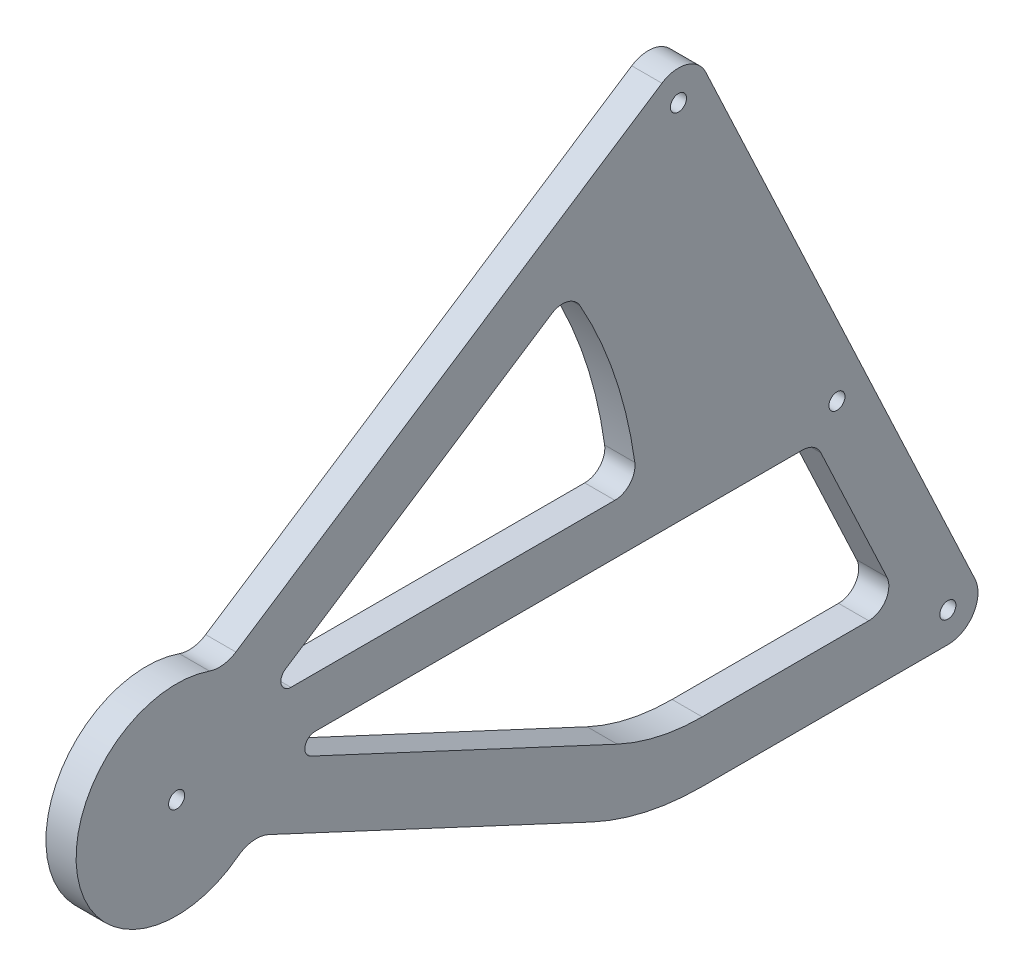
from build123d import *

# Parameters (mm, degrees)
CROQUIS1_R              = 4
SALIENTE_EXTRUIR1_DEPTH = 15
REDONDEO1_R             = 15
CROQUIS2_R              = 4
CORTAR_EXTRUIR1_DEPTH   = 15278.556264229


with BuildPart() as part:
    # Croquis1 → Saliente-Extruir1 (new body)
    with BuildSketch(Plane(origin=(0, 0, 0), x_dir=(0, 0, -1), z_dir=(1, 0, 0))):
        with BuildLine():
            Line((14338.592172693, 4743.547930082), (14331.153144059, 4738.666608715))
            Line((14331.153144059, 4738.666608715), (14141.33278017, 4614.110803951))
            ThreePointArc((14141.33278017, 4614.110803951), (14069.348167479, 4560.728559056), (14155.443599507, 4535.848343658))
            Line((14155.443599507, 4535.848343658), (14325.005020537, 4456.780554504))
            ThreePointArc((14325.005020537, 4456.780554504), (14351.808244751, 4447.682085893), (14379.945394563, 4444.600566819))
            Line((14379.945394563, 4444.600566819), (14525.706034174, 4444.600566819))
            Line((14525.706034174, 4444.600566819), (14374.356623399, 4767.015749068))
            Line((14374.356623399, 4767.015749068), (14338.592172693, 4743.547930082))
        make_face()
        with Locations((14118.554747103, 4569.600566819)):
            Circle(CROQUIS1_R, mode=Mode.SUBTRACT)
        with BuildLine():
            ThreePointArc((14429.881457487, 4564.600566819), (14435.243667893, 4563.041342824), (14438.933700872, 4558.849906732))
            Line((14438.933700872, 4558.849906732), (14471.79337789, 4488.849906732))
            ThreePointArc((14471.79337789, 4488.849906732), (14471.18191051, 4479.238356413), (14462.741134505, 4474.600566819))
            Line((14462.741134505, 4474.600566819), (14379.945394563, 4474.600566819))
            ThreePointArc((14379.945394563, 4474.600566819), (14358.301433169, 4476.970966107), (14337.683568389, 4483.969788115))
            Line((14337.683568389, 4483.969788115), (14185.210756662, 4555.069027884))
            ThreePointArc((14185.210756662, 4555.069027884), (14182.442367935, 4560.682764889), (14187.323847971, 4564.600566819))
            Line((14187.323847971, 4564.600566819), (14429.881457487, 4564.600566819))
        make_face(mode=Mode.SUBTRACT)
        with BuildLine():
            ThreePointArc((14175.396739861, 4589.600566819), (14170.606025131, 4593.169115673), (14172.653670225, 4598.780945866))
            Line((14172.653670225, 4598.780945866), (14304.945104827, 4685.587575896))
            ThreePointArc((14304.945104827, 4685.587575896), (14312.802960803, 4686.941495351), (14319.152903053, 4682.118920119))
            ThreePointArc((14319.152903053, 4682.118920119), (14336.588704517, 4642.820737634), (14346.406282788, 4600.964203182))
            ThreePointArc((14346.406282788, 4600.964203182), (14344.037477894, 4593.029279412), (14336.49969428, 4589.600566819))
            Line((14336.49969428, 4589.600566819), (14175.396739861, 4589.600566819))
        make_face(mode=Mode.SUBTRACT)
    extrude(amount=SALIENTE_EXTRUIR1_DEPTH)

    # Redondeo1
    redondeo1_edges = [part.edges().sort_by_distance(p)[0] for p in [
        (7.5, 4535.848343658, -14155.443599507),
        (7.5, 4614.110803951, -14141.33278017),
        (7.5, 4767.015749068, -14374.356623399),
        (7.5, 4444.600566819, -14525.706034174),
    ]]
    fillet(redondeo1_edges, radius=REDONDEO1_R)

    # Croquis2 → Cortar-Extruir1 (cut, through all)
    with BuildSketch(Plane(origin=(15, 0, 0), x_dir=(0, 0, -1), z_dir=(1, 0, 0))):
        with Locations((14368.126955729, 4744.987026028)):
            Circle(CROQUIS2_R)
        with Locations((14502.094196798, 4459.600566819)):
            Circle(CROQUIS2_R)
        with Locations((14446.936881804, 4577.100566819)):
            Circle(CROQUIS2_R)
    extrude(amount=-CORTAR_EXTRUIR1_DEPTH, mode=Mode.SUBTRACT)


solid = part.part
